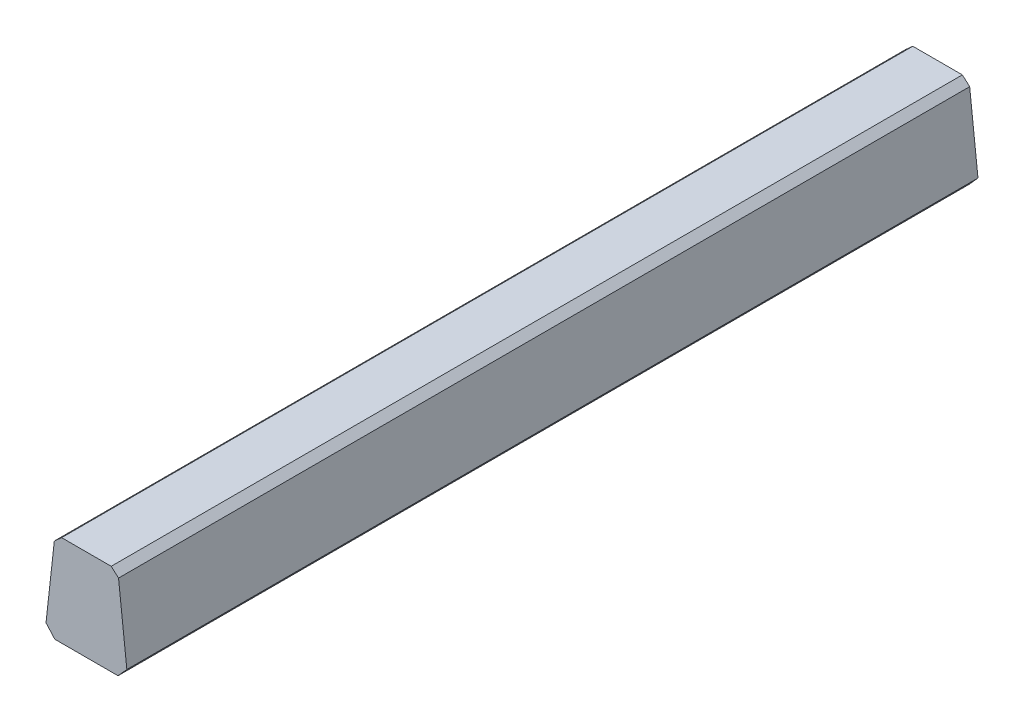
ISO-10303-21;
HEADER;
FILE_DESCRIPTION(('STEP AP214'),'2;1');
FILE_NAME('part.step','',(''),(''),'','','');
FILE_SCHEMA(('AUTOMOTIVE_DESIGN { 1 0 10303 214 1 1 1 1 }'));
ENDSEC;
DATA;
#1=APPLICATION_CONTEXT('core data for automotive mechanical design processes');
#2=APPLICATION_PROTOCOL_DEFINITION('international standard','automotive_design',2000,#1);
#3=PRODUCT_CONTEXT('',#1,'mechanical');
#4=PRODUCT('Part','Part','',(#3));
#5=PRODUCT_RELATED_PRODUCT_CATEGORY('part','',(#4));
#6=PRODUCT_DEFINITION_FORMATION('','',#4);
#7=PRODUCT_DEFINITION_CONTEXT('part definition',#1,'design');
#8=PRODUCT_DEFINITION('design','',#6,#7);
#9=PRODUCT_DEFINITION_SHAPE('','',#8);
#10=(LENGTH_UNIT() NAMED_UNIT(*) SI_UNIT(.MILLI.,.METRE.));
#11=(NAMED_UNIT(*) PLANE_ANGLE_UNIT() SI_UNIT($,.RADIAN.));
#12=(NAMED_UNIT(*) SI_UNIT($,.STERADIAN.) SOLID_ANGLE_UNIT());
#13=UNCERTAINTY_MEASURE_WITH_UNIT(LENGTH_MEASURE(1.E-05),#10,'distance_accuracy_value','');
#14=(GEOMETRIC_REPRESENTATION_CONTEXT(3) GLOBAL_UNCERTAINTY_ASSIGNED_CONTEXT((#13)) GLOBAL_UNIT_ASSIGNED_CONTEXT((#10,
#11,#12)) REPRESENTATION_CONTEXT('',''));
#15=CARTESIAN_POINT('',(0.,0.,0.));
#16=DIRECTION('',(0.,0.,1.));
#17=DIRECTION('',(1.,0.,0.));
#18=AXIS2_PLACEMENT_3D('',#15,#16,#17);
#19=CARTESIAN_POINT('',(-19.25315459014,105.9794696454,782.9));
#20=DIRECTION('',(-0.666991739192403,0.745065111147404,0.));
#21=DIRECTION('',(0.,0.,1.));
#22=AXIS2_PLACEMENT_3D('',#19,#20,#21);
#23=PLANE('',#22);
#24=DIRECTION('',(0.,0.,1.));
#25=VECTOR('',#24,1.);
#26=CARTESIAN_POINT('',(-19.25315459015,105.9794696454,267.9));
#27=LINE('',#26,#25);
#28=CARTESIAN_POINT('',(-19.25315459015,105.9794696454,267.9));
#29=VERTEX_POINT('',#28);
#30=CARTESIAN_POINT('',(-19.25315459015,105.9794696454,778.4));
#31=VERTEX_POINT('',#30);
#32=EDGE_CURVE('E190',#29,#31,#27,.T.);
#33=ORIENTED_EDGE('',*,*,#32,.T.);
#34=DIRECTION('',(0.74506511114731,0.666991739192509,0.));
#35=VECTOR('',#34,1.);
#36=CARTESIAN_POINT('',(-19.25315459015,105.9794696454,778.4));
#37=LINE('',#36,#35);
#38=CARTESIAN_POINT('',(-14.86436821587,109.9083668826,778.4));
#39=VERTEX_POINT('',#38);
#40=EDGE_CURVE('E20',#31,#39,#37,.T.);
#41=ORIENTED_EDGE('',*,*,#40,.T.);
#42=DIRECTION('',(0.,0.,1.));
#43=VECTOR('',#42,1.);
#44=CARTESIAN_POINT('',(-14.86436821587,109.9083668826,267.9));
#45=LINE('',#44,#43);
#46=CARTESIAN_POINT('',(-14.86436821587,109.9083668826,267.9));
#47=VERTEX_POINT('',#46);
#48=EDGE_CURVE('E124',#47,#39,#45,.T.);
#49=ORIENTED_EDGE('',*,*,#48,.F.);
#50=DIRECTION('',(-0.745065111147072,-0.666991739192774,1.06150650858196E-13));
#51=VECTOR('',#50,1.);
#52=CARTESIAN_POINT('',(-14.86436821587,109.9083668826,267.9));
#53=LINE('',#52,#51);
#54=EDGE_CURVE('E10',#47,#29,#53,.T.);
#55=ORIENTED_EDGE('',*,*,#54,.T.);
#56=EDGE_LOOP('',(#33,#41,#49,#55));
#57=FACE_BOUND('',#56,.T.);
#58=ADVANCED_FACE('F16',(#57),#23,.T.);
#59=CARTESIAN_POINT('',(0.,-1.448715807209E-11,267.9));
#60=DIRECTION('',(0.,0.,-1.));
#61=DIRECTION('',(-1.,0.,0.));
#62=AXIS2_PLACEMENT_3D('',#59,#60,#61);
#63=PLANE('',#62);
#64=DIRECTION('',(0.666991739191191,-0.745065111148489,0.));
#65=VECTOR('',#64,1.);
#66=CARTESIAN_POINT('',(-24.24294607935,60.99403123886,267.9));
#67=LINE('',#66,#65);
#68=CARTESIAN_POINT('',(-24.24294607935,60.99403123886,267.9));
#69=VERTEX_POINT('',#68);
#70=CARTESIAN_POINT('',(-18.95904440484,55.09163311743,267.9));
#71=VERTEX_POINT('',#70);
#72=EDGE_CURVE('E156',#69,#71,#67,.T.);
#73=ORIENTED_EDGE('',*,*,#72,.F.);
#74=DIRECTION('',(-0.110244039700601,-0.993904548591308,0.));
#75=VECTOR('',#74,1.);
#76=CARTESIAN_POINT('',(-19.25315459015,105.9794696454,267.9));
#77=LINE('',#76,#75);
#78=EDGE_CURVE('E197',#29,#69,#77,.T.);
#79=ORIENTED_EDGE('',*,*,#78,.F.);
#80=ORIENTED_EDGE('',*,*,#54,.F.);
#81=DIRECTION('',(1.,0.,0.));
#82=VECTOR('',#81,1.);
#83=CARTESIAN_POINT('',(-14.86436821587,109.9083668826,267.9));
#84=LINE('',#83,#82);
#85=CARTESIAN_POINT('',(14.86436821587,109.9083668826,267.9));
#86=VERTEX_POINT('',#85);
#87=EDGE_CURVE('E107',#47,#86,#84,.T.);
#88=ORIENTED_EDGE('',*,*,#87,.T.);
#89=DIRECTION('',(-0.745065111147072,0.666991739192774,-1.15800710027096E-13));
#90=VECTOR('',#89,1.);
#91=CARTESIAN_POINT('',(19.25315459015,105.9794696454,267.9));
#92=LINE('',#91,#90);
#93=CARTESIAN_POINT('',(19.25315459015,105.9794696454,267.9));
#94=VERTEX_POINT('',#93);
#95=EDGE_CURVE('E110',#94,#86,#92,.T.);
#96=ORIENTED_EDGE('',*,*,#95,.F.);
#97=DIRECTION('',(-0.110244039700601,0.993904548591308,0.));
#98=VECTOR('',#97,1.);
#99=CARTESIAN_POINT('',(24.24294607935,60.99403123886,267.9));
#100=LINE('',#99,#98);
#101=CARTESIAN_POINT('',(24.24294607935,60.99403123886,267.9));
#102=VERTEX_POINT('',#101);
#103=EDGE_CURVE('E128',#102,#94,#100,.T.);
#104=ORIENTED_EDGE('',*,*,#103,.F.);
#105=DIRECTION('',(0.666991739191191,0.745065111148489,0.));
#106=VECTOR('',#105,1.);
#107=CARTESIAN_POINT('',(18.95904440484,55.09163311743,267.9));
#108=LINE('',#107,#106);
#109=CARTESIAN_POINT('',(18.95904440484,55.09163311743,267.9));
#110=VERTEX_POINT('',#109);
#111=EDGE_CURVE('E149',#110,#102,#108,.T.);
#112=ORIENTED_EDGE('',*,*,#111,.F.);
#113=DIRECTION('',(-1.,0.,0.));
#114=VECTOR('',#113,1.);
#115=CARTESIAN_POINT('',(18.95904440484,55.09163311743,267.9));
#116=LINE('',#115,#114);
#117=EDGE_CURVE('E27',#110,#71,#116,.T.);
#118=ORIENTED_EDGE('',*,*,#117,.T.);
#119=EDGE_LOOP('',(#73,#79,#80,#88,#96,#104,#112,#118));
#120=FACE_BOUND('',#119,.T.);
#121=ADVANCED_FACE('F109',(#120),#63,.T.);
#122=CARTESIAN_POINT('',(0.,55.0916331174,782.9));
#123=DIRECTION('',(0.,-1.,0.));
#124=DIRECTION('',(0.,0.,-1.));
#125=AXIS2_PLACEMENT_3D('',#122,#123,#124);
#126=PLANE('',#125);
#127=DIRECTION('',(0.,0.,1.));
#128=VECTOR('',#127,1.);
#129=CARTESIAN_POINT('',(-18.95904440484,55.09163311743,267.9));
#130=LINE('',#129,#128);
#131=CARTESIAN_POINT('',(-18.95904440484,55.0916331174,778.4));
#132=VERTEX_POINT('',#131);
#133=EDGE_CURVE('E139',#71,#132,#130,.T.);
#134=ORIENTED_EDGE('',*,*,#133,.F.);
#135=ORIENTED_EDGE('',*,*,#117,.F.);
#136=DIRECTION('',(0.,0.,1.));
#137=VECTOR('',#136,1.);
#138=CARTESIAN_POINT('',(18.95904440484,55.09163311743,267.9));
#139=LINE('',#138,#137);
#140=CARTESIAN_POINT('',(18.95904440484,55.0916331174,778.4));
#141=VERTEX_POINT('',#140);
#142=EDGE_CURVE('E175',#110,#141,#139,.T.);
#143=ORIENTED_EDGE('',*,*,#142,.T.);
#144=DIRECTION('',(1.,0.,0.));
#145=VECTOR('',#144,1.);
#146=CARTESIAN_POINT('',(-18.95904440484,55.0916331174,778.4));
#147=LINE('',#146,#145);
#148=EDGE_CURVE('E170',#132,#141,#147,.T.);
#149=ORIENTED_EDGE('',*,*,#148,.F.);
#150=EDGE_LOOP('',(#134,#135,#143,#149));
#151=FACE_BOUND('',#150,.T.);
#152=ADVANCED_FACE('F218',(#151),#126,.T.);
#153=CARTESIAN_POINT('',(0.,-4.209333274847E-11,778.4));
#154=DIRECTION('',(0.,0.,-1.));
#155=DIRECTION('',(-1.,0.,0.));
#156=AXIS2_PLACEMENT_3D('',#153,#154,#155);
#157=PLANE('',#156);
#158=ORIENTED_EDGE('',*,*,#40,.F.);
#159=DIRECTION('',(0.110244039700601,0.993904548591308,0.));
#160=VECTOR('',#159,1.);
#161=CARTESIAN_POINT('',(-24.24294607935,60.99403123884,778.4));
#162=LINE('',#161,#160);
#163=CARTESIAN_POINT('',(-24.24294607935,60.99403123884,778.4));
#164=VERTEX_POINT('',#163);
#165=EDGE_CURVE('E146',#164,#31,#162,.T.);
#166=ORIENTED_EDGE('',*,*,#165,.F.);
#167=DIRECTION('',(-0.666991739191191,0.745065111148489,0.));
#168=VECTOR('',#167,1.);
#169=CARTESIAN_POINT('',(-18.95904440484,55.0916331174,778.4));
#170=LINE('',#169,#168);
#171=EDGE_CURVE('E154',#132,#164,#170,.T.);
#172=ORIENTED_EDGE('',*,*,#171,.F.);
#173=ORIENTED_EDGE('',*,*,#148,.T.);
#174=DIRECTION('',(-0.666991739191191,-0.745065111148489,0.));
#175=VECTOR('',#174,1.);
#176=CARTESIAN_POINT('',(24.24294607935,60.99403123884,778.4));
#177=LINE('',#176,#175);
#178=CARTESIAN_POINT('',(24.24294607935,60.99403123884,778.4));
#179=VERTEX_POINT('',#178);
#180=EDGE_CURVE('E167',#179,#141,#177,.T.);
#181=ORIENTED_EDGE('',*,*,#180,.F.);
#182=DIRECTION('',(0.110244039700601,-0.993904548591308,0.));
#183=VECTOR('',#182,1.);
#184=CARTESIAN_POINT('',(19.25315459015,105.9794696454,778.4));
#185=LINE('',#184,#183);
#186=CARTESIAN_POINT('',(19.25315459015,105.9794696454,778.4));
#187=VERTEX_POINT('',#186);
#188=EDGE_CURVE('E136',#187,#179,#185,.T.);
#189=ORIENTED_EDGE('',*,*,#188,.F.);
#190=DIRECTION('',(0.74506511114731,-0.666991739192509,0.));
#191=VECTOR('',#190,1.);
#192=CARTESIAN_POINT('',(14.86436821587,109.9083668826,778.4));
#193=LINE('',#192,#191);
#194=CARTESIAN_POINT('',(14.86436821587,109.9083668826,778.4));
#195=VERTEX_POINT('',#194);
#196=EDGE_CURVE('E99',#195,#187,#193,.T.);
#197=ORIENTED_EDGE('',*,*,#196,.F.);
#198=DIRECTION('',(-1.,0.,0.));
#199=VECTOR('',#198,1.);
#200=CARTESIAN_POINT('',(14.86436821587,109.9083668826,778.4));
#201=LINE('',#200,#199);
#202=EDGE_CURVE('E117',#195,#39,#201,.T.);
#203=ORIENTED_EDGE('',*,*,#202,.T.);
#204=EDGE_LOOP('',(#158,#166,#172,#173,#181,#189,#197,#203));
#205=FACE_BOUND('',#204,.T.);
#206=ADVANCED_FACE('F168',(#205),#157,.F.);
#207=CARTESIAN_POINT('',(-14.86436821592,109.9083668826,782.9));
#208=DIRECTION('',(0.,1.,0.));
#209=DIRECTION('',(0.,0.,-1.));
#210=AXIS2_PLACEMENT_3D('',#207,#208,#209);
#211=PLANE('',#210);
#212=ORIENTED_EDGE('',*,*,#48,.T.);
#213=ORIENTED_EDGE('',*,*,#202,.F.);
#214=DIRECTION('',(0.,0.,1.));
#215=VECTOR('',#214,1.);
#216=CARTESIAN_POINT('',(14.86436821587,109.9083668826,267.9));
#217=LINE('',#216,#215);
#218=EDGE_CURVE('E120',#86,#195,#217,.T.);
#219=ORIENTED_EDGE('',*,*,#218,.F.);
#220=ORIENTED_EDGE('',*,*,#87,.F.);
#221=EDGE_LOOP('',(#212,#213,#219,#220));
#222=FACE_BOUND('',#221,.T.);
#223=ADVANCED_FACE('F126',(#222),#211,.T.);
#224=CARTESIAN_POINT('',(19.25315459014,105.9794696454,782.9));
#225=DIRECTION('',(-0.666991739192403,-0.745065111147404,0.));
#226=DIRECTION('',(-0.745065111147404,0.666991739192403,0.));
#227=AXIS2_PLACEMENT_3D('',#224,#225,#226);
#228=PLANE('',#227);
#229=ORIENTED_EDGE('',*,*,#218,.T.);
#230=ORIENTED_EDGE('',*,*,#196,.T.);
#231=DIRECTION('',(0.,0.,1.));
#232=VECTOR('',#231,1.);
#233=CARTESIAN_POINT('',(19.25315459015,105.9794696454,267.9));
#234=LINE('',#233,#232);
#235=EDGE_CURVE('E122',#94,#187,#234,.T.);
#236=ORIENTED_EDGE('',*,*,#235,.F.);
#237=ORIENTED_EDGE('',*,*,#95,.T.);
#238=EDGE_LOOP('',(#229,#230,#236,#237));
#239=FACE_BOUND('',#238,.T.);
#240=ADVANCED_FACE('F119',(#239),#228,.F.);
#241=CARTESIAN_POINT('',(24.24294607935,60.99403123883,782.9));
#242=DIRECTION('',(-0.993904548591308,-0.110244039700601,0.));
#243=DIRECTION('',(-0.110244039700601,0.993904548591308,0.));
#244=AXIS2_PLACEMENT_3D('',#241,#242,#243);
#245=PLANE('',#244);
#246=ORIENTED_EDGE('',*,*,#235,.T.);
#247=ORIENTED_EDGE('',*,*,#188,.T.);
#248=DIRECTION('',(0.,0.,1.));
#249=VECTOR('',#248,1.);
#250=CARTESIAN_POINT('',(24.24294607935,60.99403123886,267.9));
#251=LINE('',#250,#249);
#252=EDGE_CURVE('E164',#102,#179,#251,.T.);
#253=ORIENTED_EDGE('',*,*,#252,.F.);
#254=ORIENTED_EDGE('',*,*,#103,.T.);
#255=EDGE_LOOP('',(#246,#247,#253,#254));
#256=FACE_BOUND('',#255,.T.);
#257=ADVANCED_FACE('F18',(#256),#245,.F.);
#258=CARTESIAN_POINT('',(18.95904440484,55.0916331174,782.9));
#259=DIRECTION('',(-0.745065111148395,0.666991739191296,0.));
#260=DIRECTION('',(0.,0.,1.));
#261=AXIS2_PLACEMENT_3D('',#258,#259,#260);
#262=PLANE('',#261);
#263=ORIENTED_EDGE('',*,*,#252,.T.);
#264=ORIENTED_EDGE('',*,*,#180,.T.);
#265=ORIENTED_EDGE('',*,*,#142,.F.);
#266=ORIENTED_EDGE('',*,*,#111,.T.);
#267=EDGE_LOOP('',(#263,#264,#265,#266));
#268=FACE_BOUND('',#267,.T.);
#269=ADVANCED_FACE('F178',(#268),#262,.F.);
#270=CARTESIAN_POINT('',(-18.95904440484,55.0916331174,782.9));
#271=DIRECTION('',(-0.745065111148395,-0.666991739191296,0.));
#272=DIRECTION('',(-0.666991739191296,0.745065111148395,0.));
#273=AXIS2_PLACEMENT_3D('',#270,#271,#272);
#274=PLANE('',#273);
#275=ORIENTED_EDGE('',*,*,#133,.T.);
#276=ORIENTED_EDGE('',*,*,#171,.T.);
#277=DIRECTION('',(0.,0.,1.));
#278=VECTOR('',#277,1.);
#279=CARTESIAN_POINT('',(-24.24294607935,60.99403123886,267.9));
#280=LINE('',#279,#278);
#281=EDGE_CURVE('E142',#69,#164,#280,.T.);
#282=ORIENTED_EDGE('',*,*,#281,.F.);
#283=ORIENTED_EDGE('',*,*,#72,.T.);
#284=EDGE_LOOP('',(#275,#276,#282,#283));
#285=FACE_BOUND('',#284,.T.);
#286=ADVANCED_FACE('F217',(#285),#274,.T.);
#287=CARTESIAN_POINT('',(-24.24294607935,60.99403123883,782.9));
#288=DIRECTION('',(-0.993904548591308,0.110244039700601,0.));
#289=DIRECTION('',(0.,0.,1.));
#290=AXIS2_PLACEMENT_3D('',#287,#288,#289);
#291=PLANE('',#290);
#292=ORIENTED_EDGE('',*,*,#281,.T.);
#293=ORIENTED_EDGE('',*,*,#165,.T.);
#294=ORIENTED_EDGE('',*,*,#32,.F.);
#295=ORIENTED_EDGE('',*,*,#78,.T.);
#296=EDGE_LOOP('',(#292,#293,#294,#295));
#297=FACE_BOUND('',#296,.T.);
#298=ADVANCED_FACE('F334',(#297),#291,.T.);
#299=CLOSED_SHELL('',(#58,#121,#152,#206,#223,#240,#257,#269,#286,#298));
#300=MANIFOLD_SOLID_BREP('B1',#299);
#301=ADVANCED_BREP_SHAPE_REPRESENTATION('',(#18,#300),#14);
#302=SHAPE_DEFINITION_REPRESENTATION(#9,#301);
ENDSEC;
END-ISO-10303-21;
